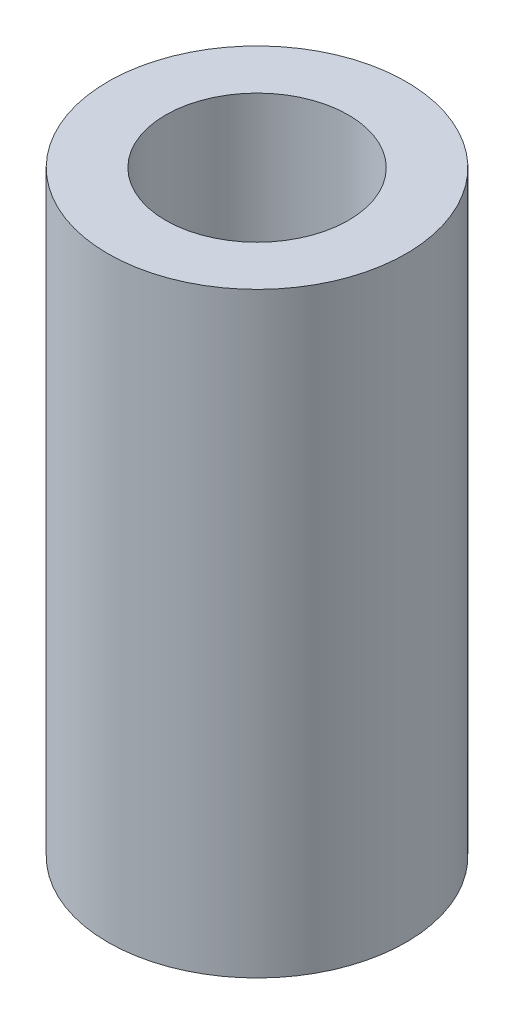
ISO-10303-21;
HEADER;
FILE_DESCRIPTION(('STEP AP214'),'2;1');
FILE_NAME('part.step','',(''),(''),'','','');
FILE_SCHEMA(('AUTOMOTIVE_DESIGN { 1 0 10303 214 1 1 1 1 }'));
ENDSEC;
DATA;
#1=APPLICATION_CONTEXT('core data for automotive mechanical design processes');
#2=APPLICATION_PROTOCOL_DEFINITION('international standard','automotive_design',2000,#1);
#3=PRODUCT_CONTEXT('',#1,'mechanical');
#4=PRODUCT('Part','Part','',(#3));
#5=PRODUCT_RELATED_PRODUCT_CATEGORY('part','',(#4));
#6=PRODUCT_DEFINITION_FORMATION('','',#4);
#7=PRODUCT_DEFINITION_CONTEXT('part definition',#1,'design');
#8=PRODUCT_DEFINITION('design','',#6,#7);
#9=PRODUCT_DEFINITION_SHAPE('','',#8);
#10=(LENGTH_UNIT() NAMED_UNIT(*) SI_UNIT(.MILLI.,.METRE.));
#11=(NAMED_UNIT(*) PLANE_ANGLE_UNIT() SI_UNIT($,.RADIAN.));
#12=(NAMED_UNIT(*) SI_UNIT($,.STERADIAN.) SOLID_ANGLE_UNIT());
#13=UNCERTAINTY_MEASURE_WITH_UNIT(LENGTH_MEASURE(1.E-05),#10,'distance_accuracy_value','');
#14=(GEOMETRIC_REPRESENTATION_CONTEXT(3) GLOBAL_UNCERTAINTY_ASSIGNED_CONTEXT((#13)) GLOBAL_UNIT_ASSIGNED_CONTEXT((#10,
#11,#12)) REPRESENTATION_CONTEXT('',''));
#15=CARTESIAN_POINT('',(0.,0.,0.));
#16=DIRECTION('',(0.,0.,1.));
#17=DIRECTION('',(1.,0.,0.));
#18=AXIS2_PLACEMENT_3D('',#15,#16,#17);
#19=CARTESIAN_POINT('',(0.,15.5,0.));
#20=DIRECTION('',(0.,1.,0.));
#21=DIRECTION('',(0.,0.,1.));
#22=AXIS2_PLACEMENT_3D('',#19,#20,#21);
#23=PLANE('',#22);
#24=CARTESIAN_POINT('',(0.,15.5,0.));
#25=DIRECTION('',(0.,1.,0.));
#26=DIRECTION('',(0.,0.,1.));
#27=AXIS2_PLACEMENT_3D('',#24,#25,#26);
#28=CIRCLE('',#27,3.875);
#29=CARTESIAN_POINT('',(0.,15.5,3.875));
#30=VERTEX_POINT('',#29);
#31=EDGE_CURVE('E10',#30,#30,#28,.T.);
#32=ORIENTED_EDGE('',*,*,#31,.T.);
#33=EDGE_LOOP('',(#32));
#34=FACE_BOUND('',#33,.T.);
#35=CARTESIAN_POINT('',(0.,15.5,0.));
#36=DIRECTION('',(0.,1.,0.));
#37=DIRECTION('',(0.,0.,1.));
#38=AXIS2_PLACEMENT_3D('',#35,#36,#37);
#39=CIRCLE('',#38,2.375);
#40=CARTESIAN_POINT('',(0.,15.5,2.375));
#41=VERTEX_POINT('',#40);
#42=EDGE_CURVE('E46',#41,#41,#39,.T.);
#43=ORIENTED_EDGE('',*,*,#42,.F.);
#44=EDGE_LOOP('',(#43));
#45=FACE_BOUND('',#44,.T.);
#46=ADVANCED_FACE('F35',(#34,#45),#23,.T.);
#47=CARTESIAN_POINT('',(0.,0.,0.));
#48=DIRECTION('',(0.,1.,0.));
#49=DIRECTION('',(0.,0.,1.));
#50=AXIS2_PLACEMENT_3D('',#47,#48,#49);
#51=PLANE('',#50);
#52=CARTESIAN_POINT('',(0.,0.,0.));
#53=DIRECTION('',(0.,1.,0.));
#54=DIRECTION('',(0.,0.,1.));
#55=AXIS2_PLACEMENT_3D('',#52,#53,#54);
#56=CIRCLE('',#55,3.875);
#57=CARTESIAN_POINT('',(0.,0.,3.875));
#58=VERTEX_POINT('',#57);
#59=EDGE_CURVE('E39',#58,#58,#56,.T.);
#60=ORIENTED_EDGE('',*,*,#59,.F.);
#61=EDGE_LOOP('',(#60));
#62=FACE_BOUND('',#61,.T.);
#63=CARTESIAN_POINT('',(0.,0.,0.));
#64=DIRECTION('',(0.,1.,0.));
#65=DIRECTION('',(0.,0.,1.));
#66=AXIS2_PLACEMENT_3D('',#63,#64,#65);
#67=CIRCLE('',#66,2.375);
#68=CARTESIAN_POINT('',(0.,0.,2.375));
#69=VERTEX_POINT('',#68);
#70=EDGE_CURVE('E48',#69,#69,#67,.T.);
#71=ORIENTED_EDGE('',*,*,#70,.T.);
#72=EDGE_LOOP('',(#71));
#73=FACE_BOUND('',#72,.T.);
#74=ADVANCED_FACE('F58',(#62,#73),#51,.F.);
#75=CARTESIAN_POINT('',(0.,15.5,0.));
#76=DIRECTION('',(0.,-1.,0.));
#77=DIRECTION('',(0.,0.,-1.));
#78=AXIS2_PLACEMENT_3D('',#75,#76,#77);
#79=CYLINDRICAL_SURFACE('',#78,3.875);
#80=ORIENTED_EDGE('',*,*,#31,.F.);
#81=EDGE_LOOP('',(#80));
#82=FACE_BOUND('',#81,.T.);
#83=ORIENTED_EDGE('',*,*,#59,.T.);
#84=EDGE_LOOP('',(#83));
#85=FACE_BOUND('',#84,.T.);
#86=ADVANCED_FACE('F37',(#82,#85),#79,.T.);
#87=CARTESIAN_POINT('',(0.,15.5,0.));
#88=DIRECTION('',(0.,-1.,0.));
#89=DIRECTION('',(0.,0.,-1.));
#90=AXIS2_PLACEMENT_3D('',#87,#88,#89);
#91=CYLINDRICAL_SURFACE('',#90,2.375);
#92=ORIENTED_EDGE('',*,*,#42,.T.);
#93=EDGE_LOOP('',(#92));
#94=FACE_BOUND('',#93,.T.);
#95=ORIENTED_EDGE('',*,*,#70,.F.);
#96=EDGE_LOOP('',(#95));
#97=FACE_BOUND('',#96,.T.);
#98=ADVANCED_FACE('F54',(#94,#97),#91,.F.);
#99=CLOSED_SHELL('',(#46,#74,#86,#98));
#100=MANIFOLD_SOLID_BREP('B2',#99);
#101=ADVANCED_BREP_SHAPE_REPRESENTATION('',(#18,#100),#14);
#102=SHAPE_DEFINITION_REPRESENTATION(#9,#101);
ENDSEC;
END-ISO-10303-21;
